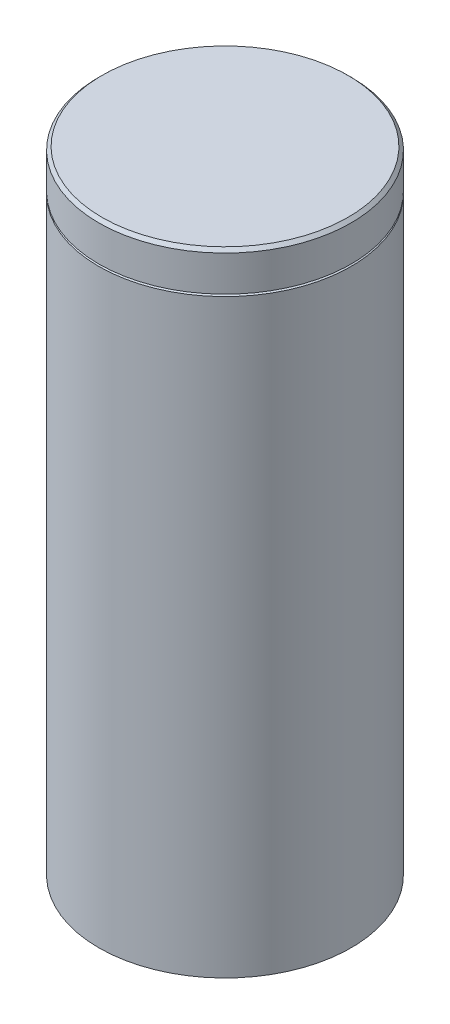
ISO-10303-21;
HEADER;
FILE_DESCRIPTION(('STEP AP214'),'2;1');
FILE_NAME('part.step','',(''),(''),'','','');
FILE_SCHEMA(('AUTOMOTIVE_DESIGN { 1 0 10303 214 1 1 1 1 }'));
ENDSEC;
DATA;
#1=APPLICATION_CONTEXT('core data for automotive mechanical design processes');
#2=APPLICATION_PROTOCOL_DEFINITION('international standard','automotive_design',2000,#1);
#3=PRODUCT_CONTEXT('',#1,'mechanical');
#4=PRODUCT('Part','Part','',(#3));
#5=PRODUCT_RELATED_PRODUCT_CATEGORY('part','',(#4));
#6=PRODUCT_DEFINITION_FORMATION('','',#4);
#7=PRODUCT_DEFINITION_CONTEXT('part definition',#1,'design');
#8=PRODUCT_DEFINITION('design','',#6,#7);
#9=PRODUCT_DEFINITION_SHAPE('','',#8);
#10=(LENGTH_UNIT() NAMED_UNIT(*) SI_UNIT(.MILLI.,.METRE.));
#11=(NAMED_UNIT(*) PLANE_ANGLE_UNIT() SI_UNIT($,.RADIAN.));
#12=(NAMED_UNIT(*) SI_UNIT($,.STERADIAN.) SOLID_ANGLE_UNIT());
#13=UNCERTAINTY_MEASURE_WITH_UNIT(LENGTH_MEASURE(1.E-05),#10,'distance_accuracy_value','');
#14=(GEOMETRIC_REPRESENTATION_CONTEXT(3) GLOBAL_UNCERTAINTY_ASSIGNED_CONTEXT((#13)) GLOBAL_UNIT_ASSIGNED_CONTEXT((#10,
#11,#12)) REPRESENTATION_CONTEXT('',''));
#15=CARTESIAN_POINT('',(0.,0.,0.));
#16=DIRECTION('',(0.,0.,1.));
#17=DIRECTION('',(1.,0.,0.));
#18=AXIS2_PLACEMENT_3D('',#15,#16,#17);
#19=CARTESIAN_POINT('',(0.,100.584,0.));
#20=DIRECTION('',(0.,-1.,0.));
#21=DIRECTION('',(0.,0.,-1.));
#22=AXIS2_PLACEMENT_3D('',#19,#20,#21);
#23=CYLINDRICAL_SURFACE('',#22,20.1168);
#24=CARTESIAN_POINT('',(0.,0.,0.));
#25=DIRECTION('',(0.,1.,0.));
#26=DIRECTION('',(0.,0.,1.));
#27=AXIS2_PLACEMENT_3D('',#24,#25,#26);
#28=CIRCLE('',#27,20.1168);
#29=CARTESIAN_POINT('',(0.,0.,20.1168));
#30=VERTEX_POINT('',#29);
#31=EDGE_CURVE('E74',#30,#30,#28,.T.);
#32=ORIENTED_EDGE('',*,*,#31,.T.);
#33=EDGE_LOOP('',(#32));
#34=FACE_BOUND('',#33,.T.);
#35=CARTESIAN_POINT('',(0.,94.0678752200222,0.));
#36=DIRECTION('',(0.,-1.,0.));
#37=DIRECTION('',(0.,0.,-1.));
#38=AXIS2_PLACEMENT_3D('',#35,#36,#37);
#39=CIRCLE('',#38,20.1168);
#40=CARTESIAN_POINT('',(0.,94.0678752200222,-20.1168));
#41=VERTEX_POINT('',#40);
#42=EDGE_CURVE('E36',#41,#41,#39,.F.);
#43=ORIENTED_EDGE('',*,*,#42,.F.);
#44=EDGE_LOOP('',(#43));
#45=FACE_BOUND('',#44,.T.);
#46=ADVANCED_FACE('F32',(#34,#45),#23,.T.);
#47=CARTESIAN_POINT('',(0.,0.,0.));
#48=DIRECTION('',(0.,1.,0.));
#49=DIRECTION('',(0.,0.,1.));
#50=AXIS2_PLACEMENT_3D('',#47,#48,#49);
#51=PLANE('',#50);
#52=CARTESIAN_POINT('',(0.,0.,0.));
#53=DIRECTION('',(0.,1.,0.));
#54=DIRECTION('',(0.,0.,1.));
#55=AXIS2_PLACEMENT_3D('',#52,#53,#54);
#56=CIRCLE('',#55,12.7);
#57=CARTESIAN_POINT('',(0.,0.,12.7));
#58=VERTEX_POINT('',#57);
#59=EDGE_CURVE('E45',#58,#58,#56,.T.);
#60=ORIENTED_EDGE('',*,*,#59,.T.);
#61=EDGE_LOOP('',(#60));
#62=FACE_BOUND('',#61,.T.);
#63=CARTESIAN_POINT('',(0.,0.,0.));
#64=DIRECTION('',(0.,-1.,0.));
#65=DIRECTION('',(0.,0.,-1.));
#66=AXIS2_PLACEMENT_3D('',#63,#64,#65);
#67=CIRCLE('',#66,18.7114045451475);
#68=CARTESIAN_POINT('',(0.,0.,-18.7114045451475));
#69=VERTEX_POINT('',#68);
#70=EDGE_CURVE('E54',#69,#69,#67,.T.);
#71=ORIENTED_EDGE('',*,*,#70,.T.);
#72=EDGE_LOOP('',(#71));
#73=FACE_BOUND('',#72,.T.);
#74=ADVANCED_FACE('F82',(#62,#73),#51,.F.);
#75=CARTESIAN_POINT('',(0.,2.794,0.));
#76=DIRECTION('',(0.,-1.,0.));
#77=DIRECTION('',(0.,0.,-1.));
#78=AXIS2_PLACEMENT_3D('',#75,#76,#77);
#79=CYLINDRICAL_SURFACE('',#78,10.16);
#80=CARTESIAN_POINT('',(0.,2.54000000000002,0.));
#81=DIRECTION('',(0.,1.,0.));
#82=DIRECTION('',(0.,0.,1.));
#83=AXIS2_PLACEMENT_3D('',#80,#81,#82);
#84=CIRCLE('',#83,10.16);
#85=CARTESIAN_POINT('',(0.,2.54000000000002,10.16));
#86=VERTEX_POINT('',#85);
#87=EDGE_CURVE('E77',#86,#86,#84,.F.);
#88=ORIENTED_EDGE('',*,*,#87,.T.);
#89=EDGE_LOOP('',(#88));
#90=FACE_BOUND('',#89,.T.);
#91=CARTESIAN_POINT('',(0.,2.794,0.));
#92=DIRECTION('',(0.,-1.,0.));
#93=DIRECTION('',(0.,0.,-1.));
#94=AXIS2_PLACEMENT_3D('',#91,#92,#93);
#95=CIRCLE('',#94,10.16);
#96=CARTESIAN_POINT('',(0.,2.794,-10.16));
#97=VERTEX_POINT('',#96);
#98=EDGE_CURVE('E69',#97,#97,#95,.T.);
#99=ORIENTED_EDGE('',*,*,#98,.F.);
#100=EDGE_LOOP('',(#99));
#101=FACE_BOUND('',#100,.T.);
#102=ADVANCED_FACE('F92',(#90,#101),#79,.F.);
#103=CARTESIAN_POINT('',(0.,2.794,0.));
#104=DIRECTION('',(0.,-1.,0.));
#105=DIRECTION('',(0.,0.,-1.));
#106=AXIS2_PLACEMENT_3D('',#103,#104,#105);
#107=PLANE('',#106);
#108=ORIENTED_EDGE('',*,*,#98,.T.);
#109=EDGE_LOOP('',(#108));
#110=FACE_BOUND('',#109,.T.);
#111=ADVANCED_FACE('F89',(#110),#107,.T.);
#112=CARTESIAN_POINT('',(0.,2.54000000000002,0.));
#113=DIRECTION('',(0.,-1.,0.));
#114=DIRECTION('',(0.,0.,-1.));
#115=AXIS2_PLACEMENT_3D('',#112,#113,#114);
#116=CONICAL_SURFACE('',#115,10.16,0.785398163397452);
#117=ORIENTED_EDGE('',*,*,#59,.F.);
#118=EDGE_LOOP('',(#117));
#119=FACE_BOUND('',#118,.T.);
#120=ORIENTED_EDGE('',*,*,#87,.F.);
#121=EDGE_LOOP('',(#120));
#122=FACE_BOUND('',#121,.T.);
#123=ADVANCED_FACE('F85',(#119,#122),#116,.F.);
#124=CARTESIAN_POINT('',(0.,0.254,0.));
#125=DIRECTION('',(0.,-1.,0.));
#126=DIRECTION('',(0.,0.,-1.));
#127=AXIS2_PLACEMENT_3D('',#124,#125,#126);
#128=CYLINDRICAL_SURFACE('',#127,18.9171358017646);
#129=CARTESIAN_POINT('',(0.,0.254,0.));
#130=DIRECTION('',(0.,-1.,0.));
#131=DIRECTION('',(0.,0.,-1.));
#132=AXIS2_PLACEMENT_3D('',#129,#130,#131);
#133=CIRCLE('',#132,18.9171358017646);
#134=CARTESIAN_POINT('',(0.,0.254,-18.9171358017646));
#135=VERTEX_POINT('',#134);
#136=EDGE_CURVE('E66',#135,#135,#133,.T.);
#137=ORIENTED_EDGE('',*,*,#136,.F.);
#138=EDGE_LOOP('',(#137));
#139=FACE_BOUND('',#138,.T.);
#140=CARTESIAN_POINT('',(0.,0.,0.));
#141=DIRECTION('',(0.,-1.,0.));
#142=DIRECTION('',(0.,0.,-1.));
#143=AXIS2_PLACEMENT_3D('',#140,#141,#142);
#144=CIRCLE('',#143,18.9171358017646);
#145=CARTESIAN_POINT('',(0.,0.,-18.9171358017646));
#146=VERTEX_POINT('',#145);
#147=EDGE_CURVE('E63',#146,#146,#144,.T.);
#148=ORIENTED_EDGE('',*,*,#147,.T.);
#149=EDGE_LOOP('',(#148));
#150=FACE_BOUND('',#149,.T.);
#151=ADVANCED_FACE('F88',(#139,#150),#128,.F.);
#152=CARTESIAN_POINT('',(0.,0.254,0.));
#153=DIRECTION('',(0.,-1.,0.));
#154=DIRECTION('',(0.,0.,-1.));
#155=AXIS2_PLACEMENT_3D('',#152,#153,#154);
#156=PLANE('',#155);
#157=CARTESIAN_POINT('',(0.,0.254,0.));
#158=DIRECTION('',(0.,-1.,0.));
#159=DIRECTION('',(0.,0.,-1.));
#160=AXIS2_PLACEMENT_3D('',#157,#158,#159);
#161=CIRCLE('',#160,18.7114045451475);
#162=CARTESIAN_POINT('',(0.,0.254,-18.7114045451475));
#163=VERTEX_POINT('',#162);
#164=EDGE_CURVE('E60',#163,#163,#161,.T.);
#165=ORIENTED_EDGE('',*,*,#164,.F.);
#166=EDGE_LOOP('',(#165));
#167=FACE_BOUND('',#166,.T.);
#168=ORIENTED_EDGE('',*,*,#136,.T.);
#169=EDGE_LOOP('',(#168));
#170=FACE_BOUND('',#169,.T.);
#171=ADVANCED_FACE('F142',(#167,#170),#156,.T.);
#172=CARTESIAN_POINT('',(0.,0.254,0.));
#173=DIRECTION('',(0.,-1.,0.));
#174=DIRECTION('',(0.,0.,-1.));
#175=AXIS2_PLACEMENT_3D('',#172,#173,#174);
#176=CYLINDRICAL_SURFACE('',#175,18.7114045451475);
#177=ORIENTED_EDGE('',*,*,#164,.T.);
#178=EDGE_LOOP('',(#177));
#179=FACE_BOUND('',#178,.T.);
#180=ORIENTED_EDGE('',*,*,#70,.F.);
#181=EDGE_LOOP('',(#180));
#182=FACE_BOUND('',#181,.T.);
#183=ADVANCED_FACE('F134',(#179,#182),#176,.T.);
#184=ORIENTED_EDGE('',*,*,#147,.F.);
#185=EDGE_LOOP('',(#184));
#186=FACE_BOUND('',#185,.T.);
#187=ORIENTED_EDGE('',*,*,#31,.F.);
#188=EDGE_LOOP('',(#187));
#189=FACE_BOUND('',#188,.T.);
#190=ADVANCED_FACE('F111',(#186,#189),#51,.F.);
#191=CARTESIAN_POINT('',(0.,94.234,0.));
#192=DIRECTION('',(0.,-1.,0.));
#193=DIRECTION('',(0.,0.,-1.));
#194=AXIS2_PLACEMENT_3D('',#191,#192,#193);
#195=CONICAL_SURFACE('',#194,19.8290634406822,1.0471975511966);
#196=CARTESIAN_POINT('',(0.,94.234,0.));
#197=DIRECTION('',(0.,1.,0.));
#198=DIRECTION('',(0.,0.,1.));
#199=AXIS2_PLACEMENT_3D('',#196,#197,#198);
#200=CIRCLE('',#199,19.8290634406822);
#201=CARTESIAN_POINT('',(0.,94.234,19.8290634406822));
#202=VERTEX_POINT('',#201);
#203=EDGE_CURVE('E50',#202,#202,#200,.T.);
#204=ORIENTED_EDGE('',*,*,#203,.F.);
#205=EDGE_LOOP('',(#204));
#206=FACE_BOUND('',#205,.T.);
#207=ORIENTED_EDGE('',*,*,#42,.T.);
#208=EDGE_LOOP('',(#207));
#209=FACE_BOUND('',#208,.T.);
#210=ADVANCED_FACE('F131',(#206,#209),#195,.T.);
#211=CARTESIAN_POINT('',(0.,103.275948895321,0.));
#212=DIRECTION('',(0.,1.,0.));
#213=DIRECTION('',(0.,0.,1.));
#214=AXIS2_PLACEMENT_3D('',#211,#212,#213);
#215=CONICAL_SURFACE('',#214,35.4901783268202,1.0471975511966);
#216=ORIENTED_EDGE('',*,*,#203,.T.);
#217=EDGE_LOOP('',(#216));
#218=FACE_BOUND('',#217,.T.);
#219=CARTESIAN_POINT('',(0.,94.4001247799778,0.));
#220=DIRECTION('',(0.,1.,0.));
#221=DIRECTION('',(0.,0.,1.));
#222=AXIS2_PLACEMENT_3D('',#219,#220,#221);
#223=CIRCLE('',#222,20.1168);
#224=CARTESIAN_POINT('',(0.,94.4001247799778,20.1168));
#225=VERTEX_POINT('',#224);
#226=EDGE_CURVE('E48',#225,#225,#223,.F.);
#227=ORIENTED_EDGE('',*,*,#226,.T.);
#228=EDGE_LOOP('',(#227));
#229=FACE_BOUND('',#228,.T.);
#230=ADVANCED_FACE('F123',(#218,#229),#215,.T.);
#231=CARTESIAN_POINT('',(0.,100.584,0.));
#232=DIRECTION('',(0.,1.,0.));
#233=DIRECTION('',(0.,0.,1.));
#234=AXIS2_PLACEMENT_3D('',#231,#232,#233);
#235=PLANE('',#234);
#236=CARTESIAN_POINT('',(0.,100.584,0.));
#237=DIRECTION('',(0.,1.,0.));
#238=DIRECTION('',(0.,0.,1.));
#239=AXIS2_PLACEMENT_3D('',#236,#237,#238);
#240=CIRCLE('',#239,19.6088);
#241=CARTESIAN_POINT('',(0.,100.584,19.6088));
#242=VERTEX_POINT('',#241);
#243=EDGE_CURVE('E40',#242,#242,#240,.T.);
#244=ORIENTED_EDGE('',*,*,#243,.T.);
#245=EDGE_LOOP('',(#244));
#246=FACE_BOUND('',#245,.T.);
#247=ADVANCED_FACE('F117',(#246),#235,.T.);
#248=CARTESIAN_POINT('',(0.,100.584,0.));
#249=DIRECTION('',(0.,-1.,0.));
#250=DIRECTION('',(0.,0.,-1.));
#251=AXIS2_PLACEMENT_3D('',#248,#249,#250);
#252=CONICAL_SURFACE('',#251,19.6088,0.785398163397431);
#253=CARTESIAN_POINT('',(0.,100.076,0.));
#254=DIRECTION('',(0.,1.,0.));
#255=DIRECTION('',(0.,0.,1.));
#256=AXIS2_PLACEMENT_3D('',#253,#254,#255);
#257=CIRCLE('',#256,20.1168);
#258=CARTESIAN_POINT('',(0.,100.076,20.1168));
#259=VERTEX_POINT('',#258);
#260=EDGE_CURVE('E10',#259,#259,#257,.F.);
#261=ORIENTED_EDGE('',*,*,#260,.F.);
#262=EDGE_LOOP('',(#261));
#263=FACE_BOUND('',#262,.T.);
#264=ORIENTED_EDGE('',*,*,#243,.F.);
#265=EDGE_LOOP('',(#264));
#266=FACE_BOUND('',#265,.T.);
#267=ADVANCED_FACE('F34',(#263,#266),#252,.T.);
#268=ORIENTED_EDGE('',*,*,#260,.T.);
#269=EDGE_LOOP('',(#268));
#270=FACE_BOUND('',#269,.T.);
#271=ORIENTED_EDGE('',*,*,#226,.F.);
#272=EDGE_LOOP('',(#271));
#273=FACE_BOUND('',#272,.T.);
#274=ADVANCED_FACE('F106',(#270,#273),#23,.T.);
#275=CLOSED_SHELL('',(#46,#74,#102,#111,#123,#151,#171,#183,#190,#210,#230,#247,#267,#274));
#276=MANIFOLD_SOLID_BREP('B2',#275);
#277=ADVANCED_BREP_SHAPE_REPRESENTATION('',(#18,#276),#14);
#278=SHAPE_DEFINITION_REPRESENTATION(#9,#277);
ENDSEC;
END-ISO-10303-21;
